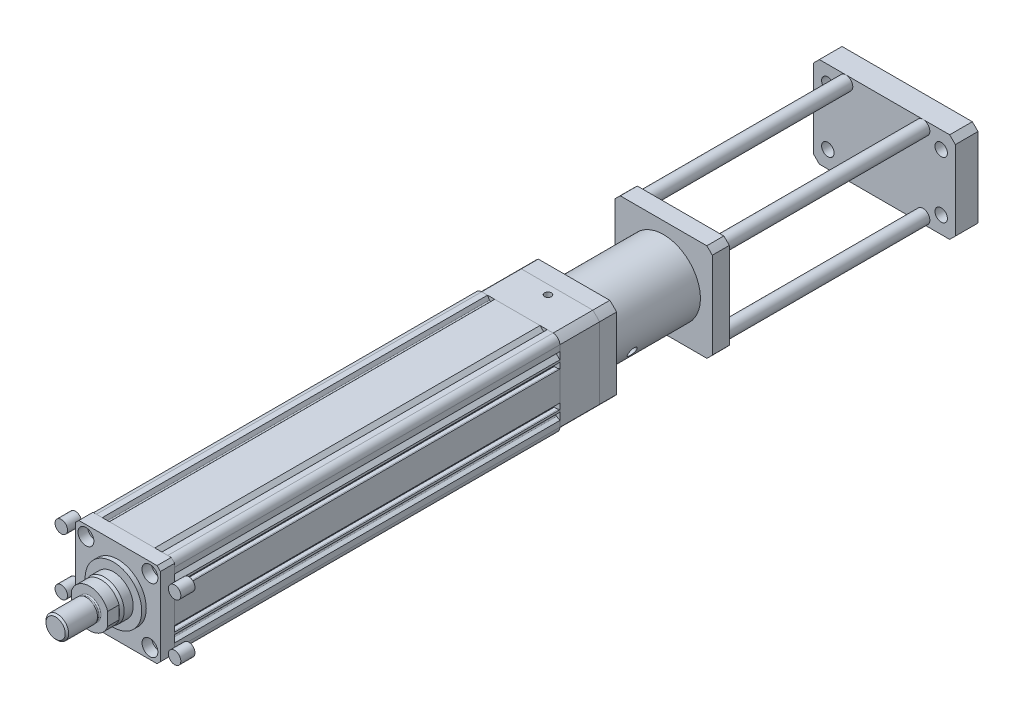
from build123d import *

# Parameters (mm, degrees)
SKETCH_1_R          = 31.5
SKETCH_1_R_2        = 3.35
EXTRUDE_1_DEPTH     = 340
SKETCH_2_R          = 5.5
EXTRUDE_1_2_DEPTH   = 12.5
EXTRUDE_1_2_2_DEPTH = 12.5
EXTRUDE_1_2_3_DEPTH = 12.5
EXTRUDE_1_2_4_DEPTH = 12.5
SKETCH_2_R_2        = 4.25
EXTRUDE_1_2_5_DEPTH = 12.5
SKETCH_3_R          = 7
SKETCH_3_R_2        = 4.25
CUT_EXTRUDE_1_DEPTH = 8.5
SKETCH_3_3_R        = 25
EXTRUDE_2_DEPTH     = 4
SKETCH_5_R          = 17.5
EXTRUDE_3_DEPTH     = 11
CHAMFER_1_SIZE      = 3
CHAMFER_1_SIZE2     = 1
EXTRUDE_4_DEPTH     = 10
SKETCH_8_R          = 9
EXTRUDE_5_DEPTH     = 3
SKETCH_9_R          = 10
EXTRUDE_6_DEPTH     = 27
CHAMFER_2_SIZE      = 1.5
FILLET_1_R          = 1
EXTRUDE_7_DEPTH     = 35
SKETCH_11_R         = 3
CUT_EXTRUDE_2_DEPTH = 5
EXTRUDE_8_DEPTH     = 15
SKETCH_13_R         = 32.5
EXTRUDE_9_DEPTH     = 79
EXTRUDE_10_DEPTH    = 15
SKETCH_15_R         = 40
CUT_EXTRUDE_3_DEPTH = 6
SKETCH_15_3_R       = 26
CUT_EXTRUDE_4_DEPTH = 101
SKETCH_16_R         = 4
CUT_EXTRUDE_5_DEPTH = 33
SKETCH_17_R         = 4
CUT_EXTRUDE_6_DEPTH = 33
SKETCH_19_R         = 40
EXTRUDE_11_DEPTH    = 1
EXTRUDE_START       = 180
SKETCH_20_W         = 125
SKETCH_20_H         = 80
SKETCH_20_R         = 5.5
EXTRUDE_12_DEPTH    = 20
SKETCH_21_R         = 6
EXTRUDE_13_DEPTH    = 180
EXTRUDE_13_2_DEPTH  = 180
EXTRUDE_13_3_DEPTH  = 180
EXTRUDE_13_4_DEPTH  = 180
CHAMFER_3_SIZE      = 5


with BuildPart() as part:
    # Sketch 1 → Extrude 1 (new body)
    with BuildSketch(Plane.XY):
        with BuildLine():
            Line((-31.5, 37.5), (-26.33, 37.5))
            Line((-26.33, 37.5), (-24.66467188, 34.615567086))
            ThreePointArc((-24.66467188, 34.615567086), (-23.929172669, 34.124122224), (-23.091539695, 34.408460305))
            Line((-23.091539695, 34.408460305), (-20, 37.5))
            Line((-20, 37.5), (20, 37.5))
            Line((20, 37.5), (23.091539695, 34.408460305))
            ThreePointArc((23.091539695, 34.408460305), (23.929172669, 34.124122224), (24.66467188, 34.615567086))
            Line((24.66467188, 34.615567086), (26.33, 37.5))
            Line((26.33, 37.5), (31.5, 37.5))
            ThreePointArc((31.5, 37.5), (35.742640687, 35.742640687), (37.5, 31.5))
            Line((37.5, 31.5), (37.5, 26.33))
            Line((37.5, 26.33), (34.615567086, 24.66467188))
            ThreePointArc((34.615567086, 24.66467188), (34.124122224, 23.929172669), (34.408460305, 23.091539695))
            Line((34.408460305, 23.091539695), (37.5, 20))
            Line((37.5, 20), (37.5, 18.1))
            Line((37.5, 18.1), (36.5, 18.1))
            Line((36.5, 18.1), (36.5, 18.7))
            Line((36.5, 18.7), (32.5, 18.7))
            Line((32.5, 18.7), (32.5, 12.4))
            Line((32.5, 12.4), (36.5, 12.4))
            Line((36.5, 12.4), (36.5, 13))
            Line((36.5, 13), (37.5, 13))
            Line((37.5, 13), (37.5, -13))
            Line((37.5, -13), (36.5, -13))
            Line((36.5, -13), (36.5, -12.4))
            Line((36.5, -12.4), (32.5, -12.4))
            Line((32.5, -12.4), (32.5, -18.7))
            Line((32.5, -18.7), (36.5, -18.7))
            Line((36.5, -18.7), (36.5, -18.1))
            Line((36.5, -18.1), (37.5, -18.1))
            Line((37.5, -18.1), (37.5, -20))
            Line((37.5, -20), (34.408460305, -23.091539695))
            ThreePointArc((34.408460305, -23.091539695), (34.124122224, -23.929172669), (34.615567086, -24.66467188))
            Line((34.615567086, -24.66467188), (37.5, -26.33))
            Line((37.5, -26.33), (37.5, -31.5))
            ThreePointArc((37.5, -31.5), (35.742640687, -35.742640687), (31.5, -37.5))
            Line((31.5, -37.5), (26.33, -37.5))
            Line((26.33, -37.5), (24.66467188, -34.615567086))
            ThreePointArc((24.66467188, -34.615567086), (23.929172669, -34.124122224), (23.091539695, -34.408460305))
            Line((23.091539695, -34.408460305), (20, -37.5))
            Line((20, -37.5), (18.1, -37.5))
            Line((18.1, -37.5), (18.1, -36.5))
            Line((18.1, -36.5), (18.7, -36.5))
            Line((18.7, -36.5), (18.7, -33.945032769))
            Line((18.7, -33.945032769), (12.4, -33.945032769))
            Line((12.4, -33.945032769), (12.4, -36.5))
            Line((12.4, -36.5), (13, -36.5))
            Line((13, -36.5), (13, -37.5))
            Line((13, -37.5), (-13, -37.5))
            Line((-13, -37.5), (-13, -36.5))
            Line((-13, -36.5), (-12.4, -36.5))
            Line((-12.4, -36.5), (-12.4, -33.945032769))
            Line((-12.4, -33.945032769), (-18.7, -33.945032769))
            Line((-18.7, -33.945032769), (-18.7, -36.5))
            Line((-18.7, -36.5), (-18.1, -36.5))
            Line((-18.1, -36.5), (-18.1, -37.5))
            Line((-18.1, -37.5), (-20, -37.5))
            Line((-20, -37.5), (-23.091539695, -34.408460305))
            ThreePointArc((-23.091539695, -34.408460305), (-23.929172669, -34.124122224), (-24.66467188, -34.615567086))
            Line((-24.66467188, -34.615567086), (-26.33, -37.5))
            Line((-26.33, -37.5), (-31.5, -37.5))
            ThreePointArc((-31.5, -37.5), (-35.742640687, -35.742640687), (-37.5, -31.5))
            Line((-37.5, -31.5), (-37.5, -26.33))
            Line((-37.5, -26.33), (-34.615567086, -24.66467188))
            ThreePointArc((-34.615567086, -24.66467188), (-34.124122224, -23.929172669), (-34.408460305, -23.091539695))
            Line((-34.408460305, -23.091539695), (-37.5, -20))
            Line((-37.5, -20), (-37.5, -18.1))
            Line((-37.5, -18.1), (-36.5, -18.1))
            Line((-36.5, -18.1), (-36.5, -18.7))
            Line((-36.5, -18.7), (-32.5, -18.7))
            Line((-32.5, -18.7), (-32.5, -12.4))
            Line((-32.5, -12.4), (-36.5, -12.4))
            Line((-36.5, -12.4), (-36.5, -13))
            Line((-36.5, -13), (-37.5, -13))
            Line((-37.5, -13), (-37.5, 13))
            Line((-37.5, 13), (-36.5, 13))
            Line((-36.5, 13), (-36.5, 12.4))
            Line((-36.5, 12.4), (-32.5, 12.4))
            Line((-32.5, 12.4), (-32.5, 18.7))
            Line((-32.5, 18.7), (-36.5, 18.7))
            Line((-36.5, 18.7), (-36.5, 18.1))
            Line((-36.5, 18.1), (-37.5, 18.1))
            Line((-37.5, 18.1), (-37.5, 20))
            Line((-37.5, 20), (-34.408460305, 23.091539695))
            ThreePointArc((-34.408460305, 23.091539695), (-34.124122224, 23.929172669), (-34.615567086, 24.66467188))
            Line((-34.615567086, 24.66467188), (-37.5, 26.33))
            Line((-37.5, 26.33), (-37.5, 31.5))
            ThreePointArc((-37.5, 31.5), (-35.742640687, 35.742640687), (-31.5, 37.5))
        make_face()
        Circle(SKETCH_1_R, mode=Mode.SUBTRACT)
        with Locations((-28.25, 28.25)):
            Circle(SKETCH_1_R_2, mode=Mode.SUBTRACT)
        with Locations(Location((28.25, 28.25, 0), (0, 0, 180))):
            Circle(SKETCH_1_R_2, mode=Mode.SUBTRACT)
        with Locations((28.25, -28.25)):
            Circle(SKETCH_1_R_2, mode=Mode.SUBTRACT)
        with Locations(Location((-28.25, -28.25, 0), (0, 0, 180))):
            Circle(SKETCH_1_R_2, mode=Mode.SUBTRACT)
    extrude(amount=EXTRUDE_1_DEPTH)


with BuildPart() as body_2:
    # Sketch 2 → Extrude 1 2 (new body)
    with BuildSketch(Plane.XY.offset(340)):
        with Locations((-50, 25)):
            Circle(SKETCH_2_R)
    extrude(amount=EXTRUDE_1_2_DEPTH)


with BuildPart() as body_3:
    # Sketch 2 → Extrude 1 2 2 (new body)
    with BuildSketch(Plane.XY.offset(340)):
        with Locations(Location((50, 25, 0), (0, 0, 180))):
            Circle(SKETCH_2_R)
    extrude(amount=EXTRUDE_1_2_2_DEPTH)


with BuildPart() as body_4:
    # Sketch 2 → Extrude 1 2 3 (new body)
    with BuildSketch(Plane.XY.offset(340)):
        with Locations(Location((-50, -25, 0), (0, 0, 180))):
            Circle(SKETCH_2_R)
    extrude(amount=EXTRUDE_1_2_3_DEPTH)


with BuildPart() as body_5:
    # Sketch 2 → Extrude 1 2 4 (new body)
    with BuildSketch(Plane.XY.offset(340)):
        with Locations((50, -25)):
            Circle(SKETCH_2_R)
    extrude(amount=EXTRUDE_1_2_4_DEPTH)


with BuildPart() as body_6:
    # Sketch 2 → Extrude 1 2 5 (new body)
    with BuildSketch(Plane.XY.offset(340)):
        Polygon((-37.5, 34.5), (-34.5, 37.5), (34.5, 37.5), (37.5, 34.5), (37.5, -34.5), (34.5, -37.5), (-34.5, -37.5), (-37.5, -34.5), align=None)
        with Locations((-28.25, 28.25)):
            Circle(SKETCH_2_R_2, mode=Mode.SUBTRACT)
        with Locations(Location((28.25, 28.25, 0), (0, 0, 180))):
            Circle(SKETCH_2_R_2, mode=Mode.SUBTRACT)
        with Locations(Location((-28.25, -28.25, 0), (0, 0, 180))):
            Circle(SKETCH_2_R_2, mode=Mode.SUBTRACT)
        with Locations((28.25, -28.25)):
            Circle(SKETCH_2_R_2, mode=Mode.SUBTRACT)
    extrude(amount=EXTRUDE_1_2_5_DEPTH)

    # Sketch 3 → Cut-Extrude 1 (cut)
    # profile 1 of 4: a face of its own
    with BuildSketch(Plane.XY.offset(352.5)):
        with Locations((28.25, -28.25)):
            Circle(SKETCH_3_R)
        with Locations((28.25, -28.25)):
            Circle(SKETCH_3_R_2, mode=Mode.SUBTRACT)
    # profile 2 of 4: a face of its own
    with BuildSketch(Plane.XY.offset(352.5)):
        with Locations((-28.25, -28.25)):
            Circle(SKETCH_3_R)
        with Locations(Location((-28.25, -28.25, 0), (0, 0, 180))):
            Circle(SKETCH_3_R_2, mode=Mode.SUBTRACT)
    # profile 3 of 4: a face of its own
    with BuildSketch(Plane.XY.offset(352.5)):
        with Locations((-28.25, 28.25)):
            Circle(SKETCH_3_R)
    # profile 4 of 4: a face of its own
    with BuildSketch(Plane.XY.offset(352.5)):
        with Locations((28.25, 28.25)):
            Circle(SKETCH_3_R)
    extrude(amount=-CUT_EXTRUDE_1_DEPTH, mode=Mode.SUBTRACT)

    # Sketch 3_3 → Extrude 2 (add)
    with BuildSketch(Plane.XY.offset(352.5)):
        Circle(SKETCH_3_3_R)
    extrude(amount=EXTRUDE_2_DEPTH)

    # Sketch 5 → Extrude 3 (add)
    with BuildSketch(Plane.XY.offset(356.5)):
        Circle(SKETCH_5_R)
    extrude(amount=EXTRUDE_3_DEPTH)

    # Chamfer 1
    chamfer_1_edges = [body_6.edges().sort_by_distance(p)[0] for p in [
        (-17.5, 0, 367.5),
    ]]
    chamfer_1_side = [body_6.faces().sort_by_distance(p)[0] for p in [
        (-17.5, 0, 362),
    ]]
    chamfer(chamfer_1_edges, length=CHAMFER_1_SIZE, length2=CHAMFER_1_SIZE2, reference=chamfer_1_side[0])

    # Sketch 6 → Extrude 4 (add)
    with BuildSketch(Plane.XY.offset(367.5)):
        with BuildLine():
            Line((-16, 5.744562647), (-16, -5.744562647))
            ThreePointArc((-16, -5.744562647), (0, -17), (16, -5.744562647))
            Line((16, -5.744562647), (16, 5.744562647))
            ThreePointArc((16, 5.744562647), (0, 17), (-16, 5.744562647))
        make_face()
    extrude(amount=EXTRUDE_4_DEPTH)

    # Sketch 8 → Extrude 5 (add)
    with BuildSketch(Plane.XY.offset(377.5)):
        Circle(SKETCH_8_R)
    extrude(amount=EXTRUDE_5_DEPTH)

    # Sketch 9 → Extrude 6 (add)
    with BuildSketch(Plane.XY.offset(380.5)):
        Circle(SKETCH_9_R)
    extrude(amount=EXTRUDE_6_DEPTH)

    # Chamfer 2
    chamfer_2_edges = [body_6.edges().sort_by_distance(p)[0] for p in [
        (-10, 0, 407.5),
    ]]
    chamfer(chamfer_2_edges, length=CHAMFER_2_SIZE)

    # Fillet 1
    fillet_1_edges = [body_6.edges().sort_by_distance(p)[0] for p in [
        (-9, 0, 377.5),
    ]]
    fillet(fillet_1_edges, radius=FILLET_1_R)


with BuildPart() as body_7:
    # Sketch 10 → Extrude 7 (new body)
    with BuildSketch(Plane(origin=(0, 0, 0), x_dir=(-1, 0, 0), z_dir=(0, 0, -1))):
        with BuildLine():
            Line((-31.539657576, 37.5), (31.539657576, 37.5))
            ThreePointArc((31.539657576, 37.5), (34.648232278, 34.648232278), (37.5, 31.539657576))
            Line((37.5, 31.539657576), (37.5, -31.539657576))
            ThreePointArc((37.5, -31.539657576), (34.648232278, -34.648232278), (31.539657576, -37.5))
            Line((31.539657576, -37.5), (-31.539657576, -37.5))
            ThreePointArc((-31.539657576, -37.5), (-34.648232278, -34.648232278), (-37.5, -31.539657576))
            Line((-37.5, -31.539657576), (-37.5, 31.539657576))
            ThreePointArc((-37.5, 31.539657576), (-34.648232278, 34.648232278), (-31.539657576, 37.5))
        make_face()
    extrude(amount=EXTRUDE_7_DEPTH)

    # Sketch 11 → Cut-Extrude 2 (cut)
    with BuildSketch(Plane(origin=(0, 37.5, 0), x_dir=(1, 0, 0), z_dir=(0, 1, 0))):
        with Locations(Location((0, 27, 0), (0, 0, 270))):
            Circle(SKETCH_11_R)
    extrude(amount=-CUT_EXTRUDE_2_DEPTH, mode=Mode.SUBTRACT)


with BuildPart() as body_8:
    # Sketch 12 → Extrude 8 (new body)
    with BuildSketch(Plane(origin=(0, 0, -35), x_dir=(-1, 0, 0), z_dir=(0, 0, -1))):
        with BuildLine():
            Line((-31.539657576, 37.5), (31.539657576, 37.5))
            ThreePointArc((31.539657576, 37.5), (34.648232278, 34.648232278), (37.5, 31.539657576))
            Line((37.5, 31.539657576), (37.5, -31.539657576))
            ThreePointArc((37.5, -31.539657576), (34.648232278, -34.648232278), (31.539657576, -37.5))
            Line((31.539657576, -37.5), (-31.539657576, -37.5))
            ThreePointArc((-31.539657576, -37.5), (-34.648232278, -34.648232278), (-37.5, -31.539657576))
            Line((-37.5, -31.539657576), (-37.5, 31.539657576))
            ThreePointArc((-37.5, 31.539657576), (-34.648232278, 34.648232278), (-31.539657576, 37.5))
        make_face()
    extrude(amount=EXTRUDE_8_DEPTH)

    # Sketch 13 → Extrude 9 (add)
    with BuildSketch(Plane(origin=(0, 0, -50), x_dir=(-1, 0, 0), z_dir=(0, 0, -1))):
        Circle(SKETCH_13_R)
    extrude(amount=EXTRUDE_9_DEPTH)

    # Sketch 14 → Extrude 10 (add)
    with BuildSketch(Plane(origin=(0, 0, -129), x_dir=(-1, 0, 0), z_dir=(0, 0, -1))):
        with BuildLine():
            Line((-38.173943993, 43), (38.173943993, 43))
            ThreePointArc((38.173943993, 43), (40.658639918, 40.658639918), (43, 38.173943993))
            Line((43, 38.173943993), (43, -38.173943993))
            ThreePointArc((43, -38.173943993), (40.658639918, -40.658639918), (38.173943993, -43))
            Line((38.173943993, -43), (-38.173943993, -43))
            ThreePointArc((-38.173943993, -43), (-40.658639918, -40.658639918), (-43, -38.173943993))
            Line((-43, -38.173943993), (-43, 38.173943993))
            ThreePointArc((-43, 38.173943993), (-40.658639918, 40.658639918), (-38.173943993, 43))
        make_face()
    extrude(amount=EXTRUDE_10_DEPTH)

    # Sketch 15 → Cut-Extrude 3 (cut)
    with BuildSketch(Plane(origin=(0, 0, -144), x_dir=(-1, 0, 0), z_dir=(0, 0, -1))):
        Circle(SKETCH_15_R)
    extrude(amount=-CUT_EXTRUDE_3_DEPTH, mode=Mode.SUBTRACT)

    # Sketch 15_3 → Cut-Extrude 4 (cut)
    with BuildSketch(Plane(origin=(0, 0, -144), x_dir=(-1, 0, 0), z_dir=(0, 0, -1))):
        Circle(SKETCH_15_3_R)
    extrude(amount=-CUT_EXTRUDE_4_DEPTH, mode=Mode.SUBTRACT)

    # Sketch 16 → Cut-Extrude 5 (cut)
    with BuildSketch(Plane.ZY.offset(43)):
        with Locations(Location((-114.809213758, 18.123645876, 0), (0, 0, 270))):
            Circle(SKETCH_16_R)
    extrude(amount=-CUT_EXTRUDE_5_DEPTH, mode=Mode.SUBTRACT)

    # Sketch 17 → Cut-Extrude 6 (cut)
    with BuildSketch(Plane(origin=(37.5, 0, 0), x_dir=(0, 0, -1), z_dir=(1, 0, 0))):
        with Locations((72.17264024, -14.20893096)):
            Circle(SKETCH_17_R)
    extrude(amount=-CUT_EXTRUDE_6_DEPTH, mode=Mode.SUBTRACT)

    # Sketch 19 → Extrude 11 (add)
    with BuildSketch(Plane(origin=(0, 0, -144), x_dir=(-1, 0, 0), z_dir=(0, 0, -1))):
        Circle(SKETCH_19_R)
    extrude(amount=-EXTRUDE_11_DEPTH)


with BuildPart() as body_9:
    # Sketch 20 → Extrude 12 (new body)
    with BuildSketch(Plane(origin=(0, 0, -144), x_dir=(-1, 0, 0), z_dir=(0, 0, -1)).offset(EXTRUDE_START)):
        Rectangle(SKETCH_20_W, SKETCH_20_H)
        with Locations((-50, 25)):
            Circle(SKETCH_20_R, mode=Mode.SUBTRACT)
        with Locations((-50, -25)):
            Circle(SKETCH_20_R, mode=Mode.SUBTRACT)
        with Locations(Location((50, -25, 0), (0, 0, 180))):
            Circle(SKETCH_20_R, mode=Mode.SUBTRACT)
        with Locations(Location((50, 25, 0), (0, 0, 180))):
            Circle(SKETCH_20_R, mode=Mode.SUBTRACT)
    extrude(amount=EXTRUDE_12_DEPTH)

    # Chamfer 3
    chamfer_3_edges = [body_9.edges().sort_by_distance(p)[0] for p in [
        (-62.5, -40, -334),
        (62.5, -40, -334),
        (62.5, 40, -334),
        (-62.5, 40, -334),
    ]]
    chamfer(chamfer_3_edges, length=CHAMFER_3_SIZE)


with BuildPart() as body_10:
    # Sketch 21 → Extrude 13 (new body)
    with BuildSketch(Plane(origin=(0, 0, -144), x_dir=(-1, 0, 0), z_dir=(0, 0, -1))):
        with Locations(Location((-34, 34, 0), (0, 0, 180))):
            Circle(SKETCH_21_R)
    extrude(amount=EXTRUDE_13_DEPTH)


with BuildPart() as body_11:
    # Sketch 21 → Extrude 13 2 (new body)
    with BuildSketch(Plane(origin=(0, 0, -144), x_dir=(-1, 0, 0), z_dir=(0, 0, -1))):
        with Locations(Location((34, 34, 0), (0, 0, 180))):
            Circle(SKETCH_21_R)
    extrude(amount=EXTRUDE_13_2_DEPTH)


with BuildPart() as body_12:
    # Sketch 21 → Extrude 13 3 (new body)
    with BuildSketch(Plane(origin=(0, 0, -144), x_dir=(-1, 0, 0), z_dir=(0, 0, -1))):
        with Locations(Location((34, -34, 0), (0, 0, 180))):
            Circle(SKETCH_21_R)
    extrude(amount=EXTRUDE_13_3_DEPTH)


with BuildPart() as body_13:
    # Sketch 21 → Extrude 13 4 (new body)
    with BuildSketch(Plane(origin=(0, 0, -144), x_dir=(-1, 0, 0), z_dir=(0, 0, -1))):
        with Locations(Location((-34, -34, 0), (0, 0, 180))):
            Circle(SKETCH_21_R)
    extrude(amount=EXTRUDE_13_4_DEPTH)


solid = Compound([part.part, body_2.part, body_3.part, body_4.part, body_5.part, body_6.part, body_7.part, body_8.part, body_9.part, body_10.part, body_11.part, body_12.part, body_13.part])
